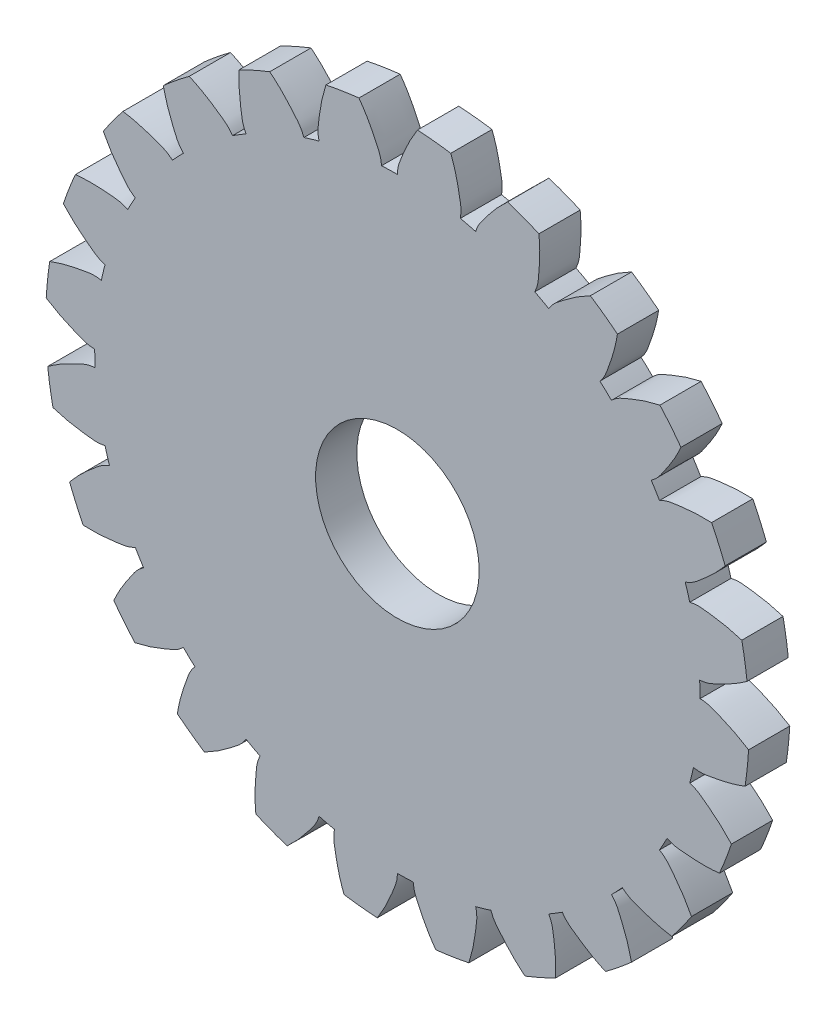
from build123d import *

# Parameters (mm, degrees)
EXTRUDE2_DEPTH     = 1.6002
SKETCH2_R          = 11.7475
EXTRUDE3_DEPTH     = 1.6002
CIRPATTERN1_COUNT  = 24
CUT_EXTRUDE1_REACH = 21.342
SKETCH5_R          = 3.175


with BuildPart() as part:
    # Sketch1 → Extrude2 (new body)
    with BuildSketch(Plane.XY):
        with BuildLine():
            ThreePointArc((2.442442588, 11.49078894), (1.227948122, 11.683145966), (0, 11.7475))
            add(Edge.make_bspline(
                [(0, 11.7475), (0.002928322, 11.807398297), (0.014613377, 12.046413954), (0.219869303, 12.551155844), (0.465450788, 13.123638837), (0.700634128, 13.503580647), (0.77904519, 13.630254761)],
                knots=[0, 0, 0, 0, 0.087307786, 0.348389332, 0.782750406, 1, 1, 1, 1], degree=3))
            ThreePointArc((0.77904519, 13.630254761), (1.427074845, 13.577710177), (2.07186813, 13.494373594))
            add(Edge.make_bspline(
                [(2.442442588, 11.49078894), (2.452031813, 11.549987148), (2.490296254, 11.786209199), (2.394467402, 12.322596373), (2.273278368, 12.933628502), (2.122228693, 13.354165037), (2.07186813, 13.494373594)],
                knots=[0, 0, 0, 0, 0.087307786, 0.348389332, 0.782750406, 1, 1, 1, 1], degree=3))
        make_face()
    extrude2 = extrude(amount=EXTRUDE2_DEPTH)

    # Sketch2 → Extrude3 (add)
    with BuildSketch(Plane.XY):
        Circle(SKETCH2_R)
    extrude(amount=EXTRUDE3_DEPTH)

    # CirPattern1: Extrude2 ×24 about axis
    cirpattern1_axis = Axis((0, 0, 14.990939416), (0, 0, -1))
    for i in range(1, CIRPATTERN1_COUNT):
        add(extrude2.rotate(cirpattern1_axis, i * 360 / CIRPATTERN1_COUNT))

    # Sketch5 → Cut-Extrude1 (cut, up to next)
    with BuildSketch(Plane.XY.offset(1.6002), mode=Mode.PRIVATE) as cut_extrude1_sk1:
        Circle(SKETCH5_R)
    cut_extrude1_tool1 = extrude(cut_extrude1_sk1.sketch, amount=-CUT_EXTRUDE1_REACH, mode=Mode.PRIVATE) & part.part
    add(cut_extrude1_tool1.solids().sort_by_distance((0, 0, 1.6002))[0], mode=Mode.SUBTRACT)


solid = part.part
